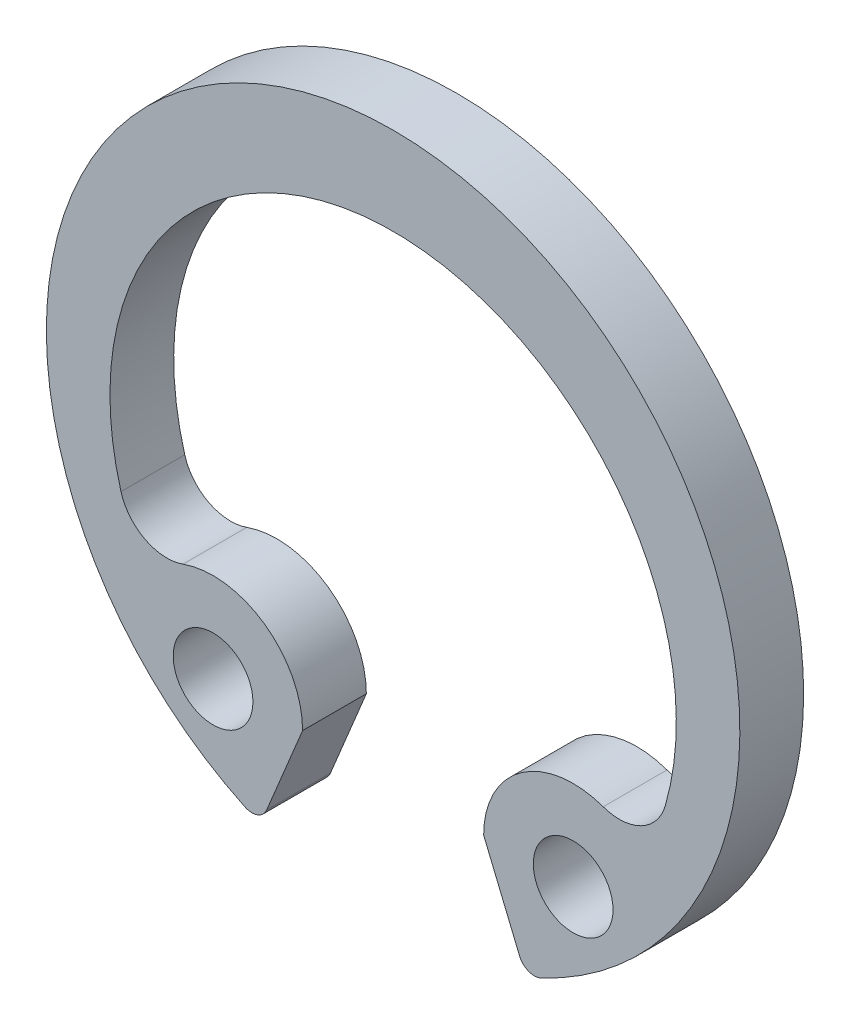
from build123d import *

# Parameters (mm, degrees)
BODYSKE_R      = 0.5
BASEBODY_DEPTH = 0.8
FILLET1_R      = 0.6
FILLET2_R      = 0.2


with BuildPart() as part:
    # BodySke → BaseBody (new body)
    with BuildSketch(Plane.XY):
        with BuildLine():
            Line((1.135741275, -2.741921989), (1.664672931, -4.018875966))
            ThreePointArc((1.664672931, -4.018875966), (0, 4.35), (-1.664672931, -4.018875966))
            Line((-1.664672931, -4.018875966), (-1.135741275, -2.741921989))
            ThreePointArc((-1.135741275, -2.741921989), (-1.634856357, -1.808143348), (-2.688558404, -1.704362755))
            Line((-2.688558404, -1.704362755), (-3.170945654, -1.904174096))
            ThreePointArc((-3.170945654, -1.904174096), (0, 3.25), (3.170945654, -1.904174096))
            Line((3.170945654, -1.904174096), (2.688558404, -1.704362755))
            ThreePointArc((2.688558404, -1.704362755), (1.634856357, -1.808143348), (1.135741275, -2.741921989))
        make_face()
        with Locations((2.258787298, -2.741921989)):
            Circle(BODYSKE_R, mode=Mode.SUBTRACT)
        with Locations((-2.258787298, -2.741921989)):
            Circle(BODYSKE_R, mode=Mode.SUBTRACT)
    extrude(amount=BASEBODY_DEPTH)

    # Fillet1
    fillet1_edges = [part.edges().sort_by_distance(p)[0] for p in [
        (3.170945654, -1.904174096, 0.4),
        (-3.170945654, -1.904174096, 0.4),
    ]]
    fillet(fillet1_edges, radius=FILLET1_R)

    # Fillet2
    fillet2_edges = [part.edges().sort_by_distance(p)[0] for p in [
        (-1.664672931, -4.018875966, 0.4),
        (1.664672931, -4.018875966, 0.4),
    ]]
    fillet(fillet2_edges, radius=FILLET2_R)


solid = part.part
